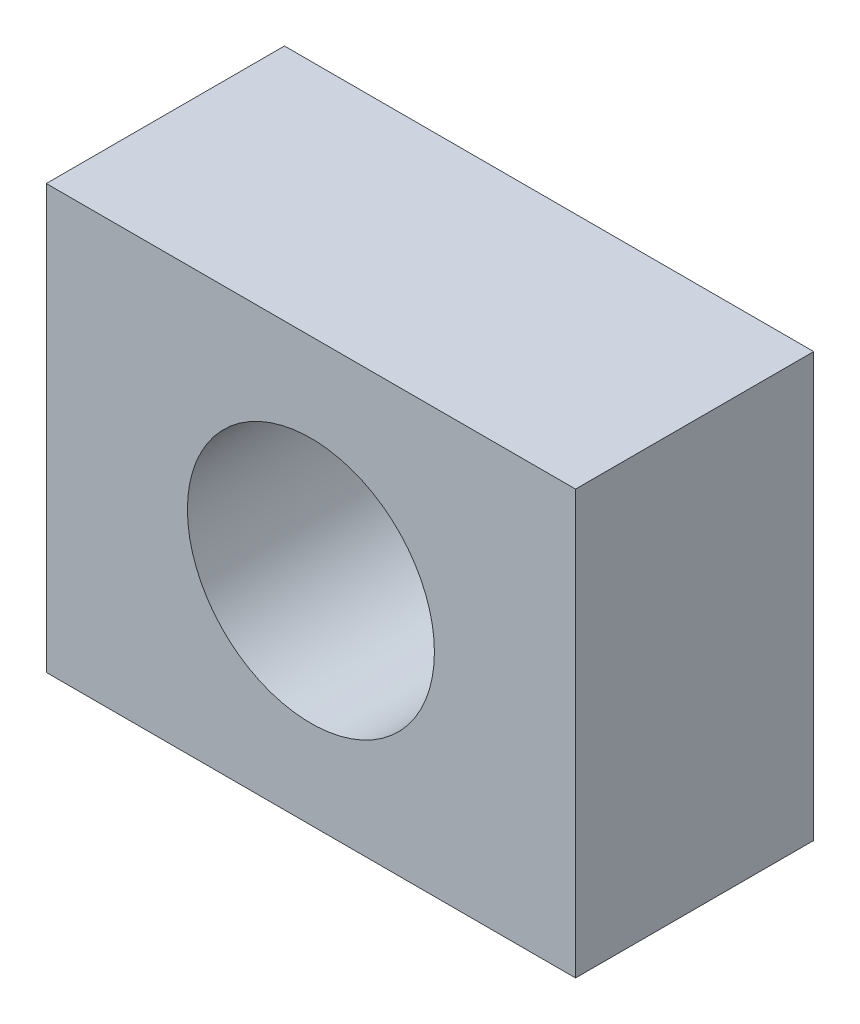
from build123d import *

# Parameters (mm, degrees)
ESQUISSE1_W      = 30
ESQUISSE1_H      = 24
ESQUISSE1_R      = 7
EXTRUSION1_DEPTH = 13.5


with BuildPart() as part:
    # Esquisse1 → Extrusion1 (new body)
    with BuildSketch(Plane.XY.offset(13.5)):
        Rectangle(ESQUISSE1_W, ESQUISSE1_H)
        with Locations(Location((0, 0, 0), (0, 0, 180))):
            Circle(ESQUISSE1_R, mode=Mode.SUBTRACT)
    extrude(amount=-EXTRUSION1_DEPTH)


solid = part.part
